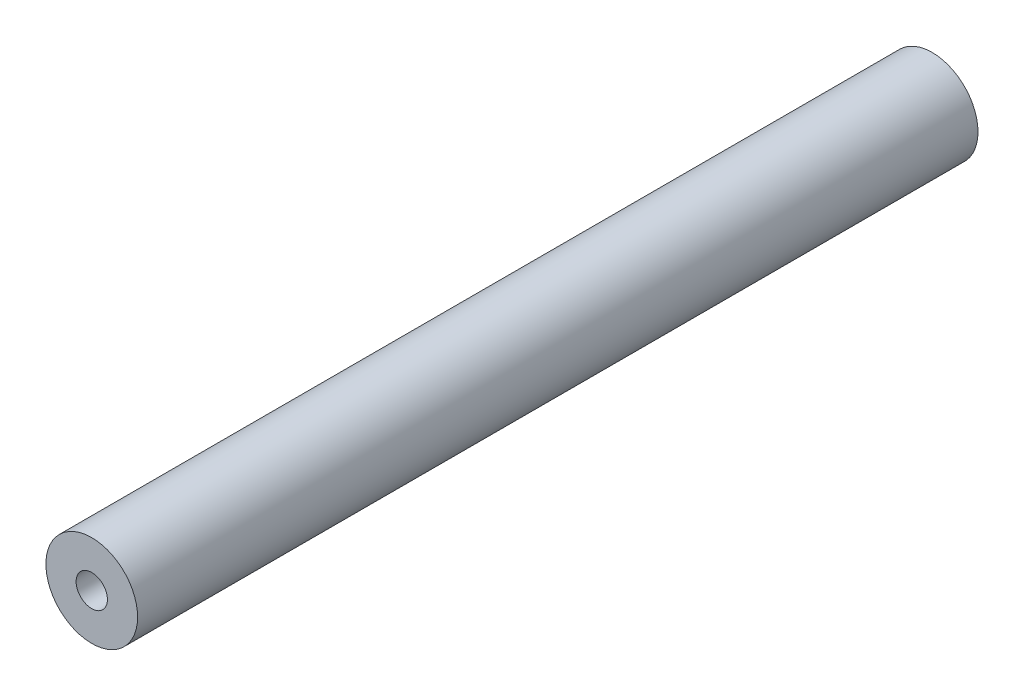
ISO-10303-21;
HEADER;
FILE_DESCRIPTION(('STEP AP214'),'2;1');
FILE_NAME('part.step','',(''),(''),'','','');
FILE_SCHEMA(('AUTOMOTIVE_DESIGN { 1 0 10303 214 1 1 1 1 }'));
ENDSEC;
DATA;
#1=APPLICATION_CONTEXT('core data for automotive mechanical design processes');
#2=APPLICATION_PROTOCOL_DEFINITION('international standard','automotive_design',2000,#1);
#3=PRODUCT_CONTEXT('',#1,'mechanical');
#4=PRODUCT('Part','Part','',(#3));
#5=PRODUCT_RELATED_PRODUCT_CATEGORY('part','',(#4));
#6=PRODUCT_DEFINITION_FORMATION('','',#4);
#7=PRODUCT_DEFINITION_CONTEXT('part definition',#1,'design');
#8=PRODUCT_DEFINITION('design','',#6,#7);
#9=PRODUCT_DEFINITION_SHAPE('','',#8);
#10=(LENGTH_UNIT() NAMED_UNIT(*) SI_UNIT(.MILLI.,.METRE.));
#11=(NAMED_UNIT(*) PLANE_ANGLE_UNIT() SI_UNIT($,.RADIAN.));
#12=(NAMED_UNIT(*) SI_UNIT($,.STERADIAN.) SOLID_ANGLE_UNIT());
#13=UNCERTAINTY_MEASURE_WITH_UNIT(LENGTH_MEASURE(1.E-05),#10,'distance_accuracy_value','');
#14=(GEOMETRIC_REPRESENTATION_CONTEXT(3) GLOBAL_UNCERTAINTY_ASSIGNED_CONTEXT((#13)) GLOBAL_UNIT_ASSIGNED_CONTEXT((#10,
#11,#12)) REPRESENTATION_CONTEXT('',''));
#15=CARTESIAN_POINT('',(0.,0.,0.));
#16=DIRECTION('',(0.,0.,1.));
#17=DIRECTION('',(1.,0.,0.));
#18=AXIS2_PLACEMENT_3D('',#15,#16,#17);
#19=CARTESIAN_POINT('',(0.,0.,55.));
#20=DIRECTION('',(0.,0.,-1.));
#21=DIRECTION('',(-1.,0.,0.));
#22=AXIS2_PLACEMENT_3D('',#19,#20,#21);
#23=CYLINDRICAL_SURFACE('',#22,3.);
#24=CARTESIAN_POINT('',(0.,0.,55.));
#25=DIRECTION('',(0.,0.,1.));
#26=DIRECTION('',(1.,0.,0.));
#27=AXIS2_PLACEMENT_3D('',#24,#25,#26);
#28=CIRCLE('',#27,3.);
#29=CARTESIAN_POINT('',(3.,0.,55.));
#30=VERTEX_POINT('',#29);
#31=EDGE_CURVE('E11',#30,#30,#28,.T.);
#32=ORIENTED_EDGE('',*,*,#31,.F.);
#33=EDGE_LOOP('',(#32));
#34=FACE_BOUND('',#33,.T.);
#35=CARTESIAN_POINT('',(0.,0.,0.));
#36=DIRECTION('',(0.,0.,1.));
#37=DIRECTION('',(1.,0.,0.));
#38=AXIS2_PLACEMENT_3D('',#35,#36,#37);
#39=CIRCLE('',#38,3.);
#40=CARTESIAN_POINT('',(3.,0.,0.));
#41=VERTEX_POINT('',#40);
#42=EDGE_CURVE('E42',#41,#41,#39,.T.);
#43=ORIENTED_EDGE('',*,*,#42,.T.);
#44=EDGE_LOOP('',(#43));
#45=FACE_BOUND('',#44,.T.);
#46=ADVANCED_FACE('F39',(#34,#45),#23,.T.);
#47=CARTESIAN_POINT('',(0.,0.,55.));
#48=DIRECTION('',(0.,0.,1.));
#49=DIRECTION('',(1.,0.,0.));
#50=AXIS2_PLACEMENT_3D('',#47,#48,#49);
#51=PLANE('',#50);
#52=CARTESIAN_POINT('',(0.,0.,55.));
#53=DIRECTION('',(0.,0.,1.));
#54=DIRECTION('',(1.,0.,0.));
#55=AXIS2_PLACEMENT_3D('',#52,#53,#54);
#56=CIRCLE('',#55,1.02499999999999);
#57=CARTESIAN_POINT('',(1.02499999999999,0.,55.));
#58=VERTEX_POINT('',#57);
#59=EDGE_CURVE('E64',#58,#58,#56,.T.);
#60=ORIENTED_EDGE('',*,*,#59,.F.);
#61=EDGE_LOOP('',(#60));
#62=FACE_BOUND('',#61,.T.);
#63=ORIENTED_EDGE('',*,*,#31,.T.);
#64=EDGE_LOOP('',(#63));
#65=FACE_BOUND('',#64,.T.);
#66=ADVANCED_FACE('F87',(#62,#65),#51,.T.);
#67=CARTESIAN_POINT('',(0.,0.,0.));
#68=DIRECTION('',(0.,0.,1.));
#69=DIRECTION('',(1.,0.,0.));
#70=AXIS2_PLACEMENT_3D('',#67,#68,#69);
#71=PLANE('',#70);
#72=CARTESIAN_POINT('',(0.,0.,0.));
#73=DIRECTION('',(0.,0.,-1.));
#74=DIRECTION('',(-1.,0.,0.));
#75=AXIS2_PLACEMENT_3D('',#72,#73,#74);
#76=CIRCLE('',#75,1.02499999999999);
#77=CARTESIAN_POINT('',(-1.02499999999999,0.,0.));
#78=VERTEX_POINT('',#77);
#79=EDGE_CURVE('E65',#78,#78,#76,.T.);
#80=ORIENTED_EDGE('',*,*,#79,.F.);
#81=EDGE_LOOP('',(#80));
#82=FACE_BOUND('',#81,.T.);
#83=ORIENTED_EDGE('',*,*,#42,.F.);
#84=EDGE_LOOP('',(#83));
#85=FACE_BOUND('',#84,.T.);
#86=ADVANCED_FACE('F84',(#82,#85),#71,.F.);
#87=CARTESIAN_POINT('',(0.,0.,51.));
#88=DIRECTION('',(0.,0.,1.));
#89=DIRECTION('',(1.,0.,0.));
#90=AXIS2_PLACEMENT_3D('',#87,#88,#89);
#91=CONICAL_SURFACE('',#90,1.02499999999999,1.02974425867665);
#92=CARTESIAN_POINT('',(0.,0.,50.3841178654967));
#93=VERTEX_POINT('',#92);
#94=VERTEX_LOOP('',#93);
#95=FACE_BOUND('',#94,.T.);
#96=CARTESIAN_POINT('',(0.,0.,51.));
#97=DIRECTION('',(0.,0.,1.));
#98=DIRECTION('',(1.,0.,0.));
#99=AXIS2_PLACEMENT_3D('',#96,#97,#98);
#100=CIRCLE('',#99,1.02499999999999);
#101=CARTESIAN_POINT('',(1.02499999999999,0.,51.));
#102=VERTEX_POINT('',#101);
#103=EDGE_CURVE('E70',#102,#102,#100,.T.);
#104=ORIENTED_EDGE('',*,*,#103,.T.);
#105=EDGE_LOOP('',(#104));
#106=FACE_BOUND('',#105,.T.);
#107=ADVANCED_FACE('F86',(#95,#106),#91,.F.);
#108=CARTESIAN_POINT('',(0.,0.,55.));
#109=DIRECTION('',(0.,0.,1.));
#110=DIRECTION('',(1.,0.,0.));
#111=AXIS2_PLACEMENT_3D('',#108,#109,#110);
#112=CYLINDRICAL_SURFACE('',#111,1.02499999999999);
#113=ORIENTED_EDGE('',*,*,#103,.F.);
#114=EDGE_LOOP('',(#113));
#115=FACE_BOUND('',#114,.T.);
#116=ORIENTED_EDGE('',*,*,#59,.T.);
#117=EDGE_LOOP('',(#116));
#118=FACE_BOUND('',#117,.T.);
#119=ADVANCED_FACE('F57',(#115,#118),#112,.F.);
#120=CARTESIAN_POINT('',(0.,0.,4.));
#121=DIRECTION('',(0.,0.,-1.));
#122=DIRECTION('',(-1.,0.,0.));
#123=AXIS2_PLACEMENT_3D('',#120,#121,#122);
#124=CONICAL_SURFACE('',#123,1.02499999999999,1.02974425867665);
#125=CARTESIAN_POINT('',(0.,0.,4.61588213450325));
#126=VERTEX_POINT('',#125);
#127=VERTEX_LOOP('',#126);
#128=FACE_BOUND('',#127,.T.);
#129=CARTESIAN_POINT('',(0.,0.,4.));
#130=DIRECTION('',(0.,0.,-1.));
#131=DIRECTION('',(-1.,0.,0.));
#132=AXIS2_PLACEMENT_3D('',#129,#130,#131);
#133=CIRCLE('',#132,1.02499999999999);
#134=CARTESIAN_POINT('',(-1.02499999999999,0.,4.));
#135=VERTEX_POINT('',#134);
#136=EDGE_CURVE('E61',#135,#135,#133,.T.);
#137=ORIENTED_EDGE('',*,*,#136,.T.);
#138=EDGE_LOOP('',(#137));
#139=FACE_BOUND('',#138,.T.);
#140=ADVANCED_FACE('F53',(#128,#139),#124,.F.);
#141=CARTESIAN_POINT('',(0.,0.,0.));
#142=DIRECTION('',(0.,0.,-1.));
#143=DIRECTION('',(-1.,0.,0.));
#144=AXIS2_PLACEMENT_3D('',#141,#142,#143);
#145=CYLINDRICAL_SURFACE('',#144,1.02499999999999);
#146=ORIENTED_EDGE('',*,*,#136,.F.);
#147=EDGE_LOOP('',(#146));
#148=FACE_BOUND('',#147,.T.);
#149=ORIENTED_EDGE('',*,*,#79,.T.);
#150=EDGE_LOOP('',(#149));
#151=FACE_BOUND('',#150,.T.);
#152=ADVANCED_FACE('F56',(#148,#151),#145,.F.);
#153=CLOSED_SHELL('',(#46,#66,#86,#107,#119,#140,#152));
#154=MANIFOLD_SOLID_BREP('B2',#153);
#155=ADVANCED_BREP_SHAPE_REPRESENTATION('',(#18,#154),#14);
#156=SHAPE_DEFINITION_REPRESENTATION(#9,#155);
ENDSEC;
END-ISO-10303-21;
